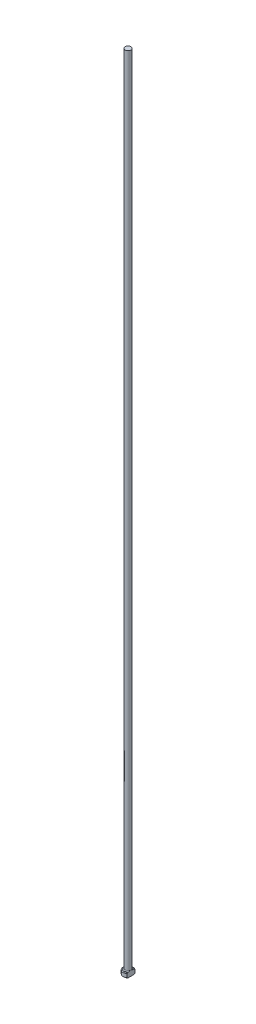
from build123d import *
from build123d.topology import SkipClean

# Parameters (mm, degrees)
CHAMFER1_SIZE = 0.2
FILLET1_R     = 0.2
KEY_DEPTH     = 251.008999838


with BuildPart() as part:
    # Sketch1 → Revolve1 (revolve)
    with BuildSketch(Plane.XY, mode=Mode.PRIVATE) as revolve1_sk:
        Polygon((0, 0), (-1.5, 0), (-1.5, 1.5), (-0.9, 1.5), (-0.9, 250), (0, 250), align=None)
    revolve(revolve1_sk.sketch.rotate(Axis((0, 259.958771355, 0), (0, -1, 0)), 270), axis=Axis((0, 259.958771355, 0), (0, -1, 0)))

    # Chamfer1
    chamfer1_edges = [part.edges().sort_by_distance(p)[0] for p in [
        (0, 1.5, -1.5),
        (0, 0, -1.5),
    ]]
    chamfer(chamfer1_edges, length=CHAMFER1_SIZE)

    # Fillet1
    fillet1_edges = [part.edges().sort_by_distance(p)[0] for p in [
        (0, 1.5, -0.9),
    ]]
    fillet(fillet1_edges, radius=FILLET1_R)

    # Sketch2 → KEY (cut, through all)
    with SkipClean():  # the faces are left unmerged after this step: merging them gives an invalid solid
        with BuildSketch(Plane(origin=(0, 0, 0), x_dir=(1, 0, 0), z_dir=(0, 1, 0))):
            with BuildLine():
                Line((0.9, 1.2), (0.9, -1.2))
                ThreePointArc((0.9, -1.2), (1.5, 0), (0.9, 1.2))
            make_face()
        extrude(amount=KEY_DEPTH, mode=Mode.SUBTRACT)


solid = part.part
